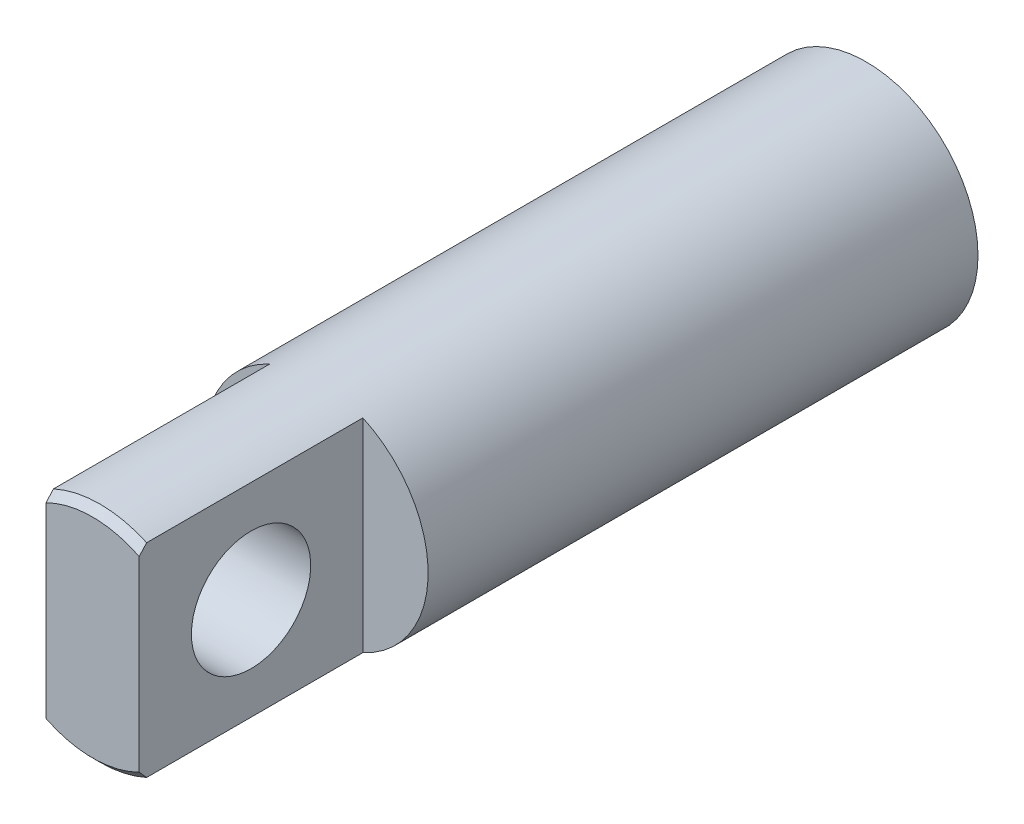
from build123d import *

# Parameters (mm, degrees)
SKETCH1_R           = 3
BOSS_EXTRUDE1_DEPTH = 14.75
BOSS_EXTRUDE2_DEPTH = 6
SKETCH3_R           = 1.6
CUT_EXTRUDE1_DEPTH  = 2.5
CHAMFER1_SIZE       = 0.2


with BuildPart() as part:
    # Sketch1 → Boss-Extrude1 (new body)
    with BuildSketch(Plane.XY):
        Circle(SKETCH1_R)
    extrude(amount=BOSS_EXTRUDE1_DEPTH)

    # Sketch2 → Boss-Extrude2 (add)
    with BuildSketch(Plane.XY.offset(14.75)):
        with BuildLine():
            Line((1.25, -2.727178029), (1.25, 2.727178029))
            ThreePointArc((1.25, 2.727178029), (0, 3), (-1.25, 2.727178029))
            Line((-1.25, 2.727178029), (-1.25, -2.727178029))
            ThreePointArc((-1.25, -2.727178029), (0, -3), (1.25, -2.727178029))
        make_face()
    extrude(amount=BOSS_EXTRUDE2_DEPTH)

    # Sketch3 → Cut-Extrude1 (cut)
    with BuildSketch(Plane.ZY.offset(1.25)):
        with Locations((17.75, 0)):
            Circle(SKETCH3_R)
    extrude(amount=-CUT_EXTRUDE1_DEPTH, mode=Mode.SUBTRACT)

    # Chamfer1
    chamfer1_edges = [part.edges().sort_by_distance(p)[0] for p in [
        (0, -3, 20.75),
        (0, 3, 20.75),
    ]]
    chamfer(chamfer1_edges, length=CHAMFER1_SIZE)


solid = part.part
